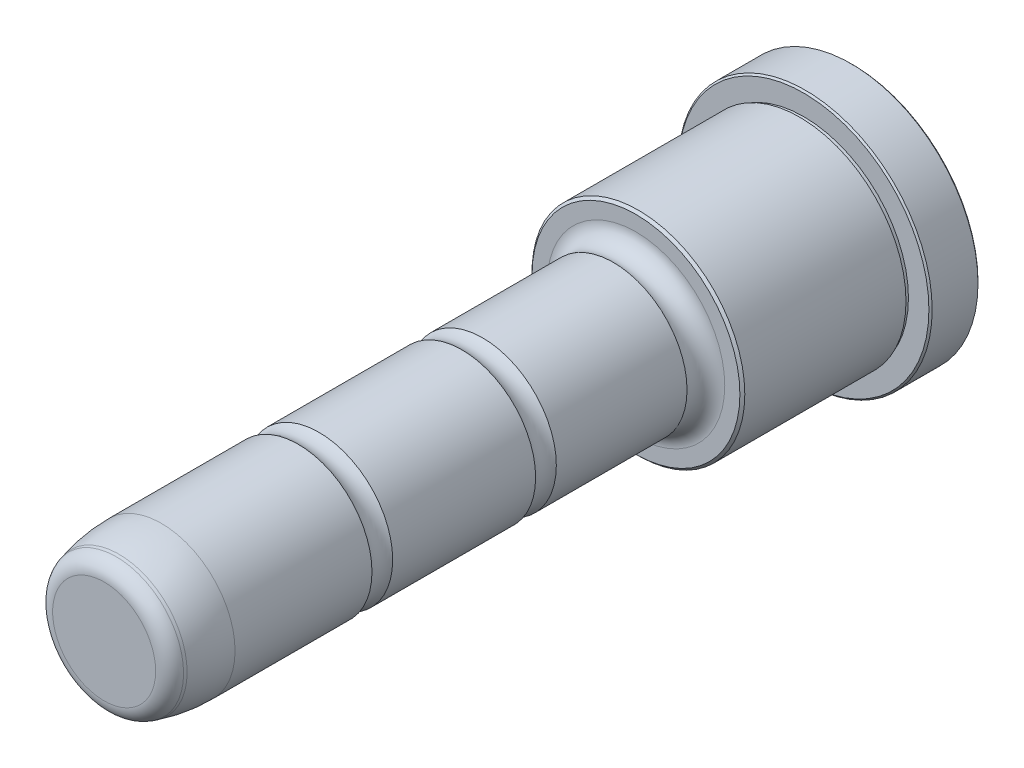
from build123d import *

# Parameters (mm, degrees)
LPATTERN1_COUNT = 2
LPATTERN1_PITCH = 20


with BuildPart() as part:
    # Sketch1 → Revolve1 (revolve)
    with BuildSketch(Plane(origin=(0, 0, 0), x_dir=(0, 0, -1), z_dir=(1, 0, 0)), mode=Mode.PRIVATE) as revolve1_sk:
        with BuildLine():
            Line((-26.75, 12.7), (-26.45, 13))
            Line((-26.45, 13), (-6.75, 13))
            Line((-6.75, 13), (-6.75, 12.8))
            Line((-6.75, 12.8), (-6.25, 12.8))
            Line((-6.25, 12.8), (-6.25, 15.3))
            Line((-6.25, 15.3), (-6.05, 15.5))
            Line((-6.05, 15.5), (-0.45, 15.5))
            Line((-0.45, 15.5), (-0.25, 15.3))
            Line((-0.25, 15.3), (-0.25, 0))
            Line((-0.25, 0), (-91.75, 0))
            Line((-91.75, 0), (-91.75, 6.295225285))
            ThreePointArc((-91.75, 6.295225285), (-91.336706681, 7.512748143), (-90.26763809, 8.227076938))
            Line((-90.26763809, 8.227076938), (-89.926380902, 8.318516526))
            ThreePointArc((-89.926380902, 8.318516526), (-87.360523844, 8.828897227), (-84.75, 9))
            Line((-84.75, 9), (-29.509934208, 9))
            ThreePointArc((-29.509934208, 9), (-27.636417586, 9.188695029), (-26.75, 10.85))
            Line((-26.75, 10.85), (-26.75, 12.7))
        make_face()
    revolve(revolve1_sk.sketch.rotate(Axis((0, 0, 0.25), (0, 0, -1)), 90), axis=Axis((0, 0, 0.25), (0, 0, -1)))

    # Sketch2 → Cut-Revolve1 (revolve, cut)
    with BuildSketch(Plane(origin=(0, 0, 0), x_dir=(0, 0, -1), z_dir=(1, 0, 0)), mode=Mode.PRIVATE) as cut_revolve1_sk:
        with BuildLine():
            Line((-68.014911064, 9), (-65.485088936, 9))
            ThreePointArc((-65.485088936, 9), (-66.75, 8.6), (-68.014911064, 9))
        make_face()
    cut_revolve1 = revolve(cut_revolve1_sk.sketch.rotate(Axis((0, 0, 91.75), (0, 0, -1)), 90), axis=Axis((0, 0, 91.75), (0, 0, -1)), mode=Mode.SUBTRACT)

    # LPattern1: Cut-Revolve1 ×2
    with Locations(*[(0, 0, -i * LPATTERN1_PITCH) for i in range(1, LPATTERN1_COUNT)]):
        add(cut_revolve1, mode=Mode.SUBTRACT)


solid = part.part
